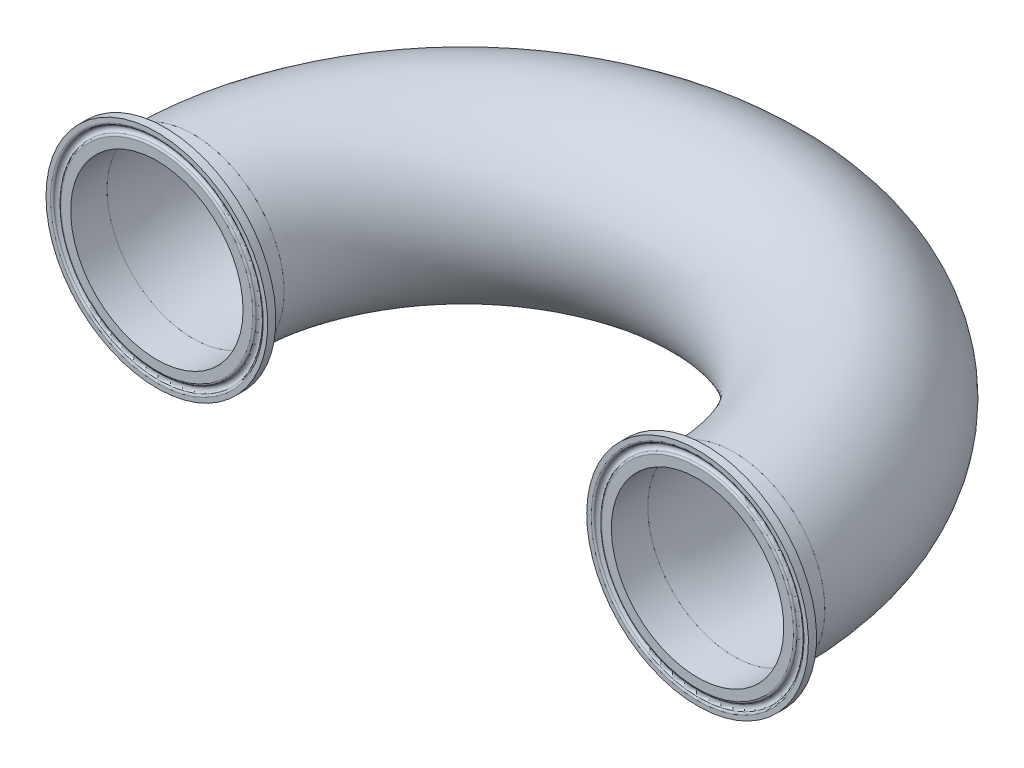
ISO-10303-21;
HEADER;
FILE_DESCRIPTION(('STEP AP214'),'2;1');
FILE_NAME('part.step','',(''),(''),'','','');
FILE_SCHEMA(('AUTOMOTIVE_DESIGN { 1 0 10303 214 1 1 1 1 }'));
ENDSEC;
DATA;
#1=APPLICATION_CONTEXT('core data for automotive mechanical design processes');
#2=APPLICATION_PROTOCOL_DEFINITION('international standard','automotive_design',2000,#1);
#3=PRODUCT_CONTEXT('',#1,'mechanical');
#4=PRODUCT('Part','Part','',(#3));
#5=PRODUCT_RELATED_PRODUCT_CATEGORY('part','',(#4));
#6=PRODUCT_DEFINITION_FORMATION('','',#4);
#7=PRODUCT_DEFINITION_CONTEXT('part definition',#1,'design');
#8=PRODUCT_DEFINITION('design','',#6,#7);
#9=PRODUCT_DEFINITION_SHAPE('','',#8);
#10=(LENGTH_UNIT() NAMED_UNIT(*) SI_UNIT(.MILLI.,.METRE.));
#11=(NAMED_UNIT(*) PLANE_ANGLE_UNIT() SI_UNIT($,.RADIAN.));
#12=(NAMED_UNIT(*) SI_UNIT($,.STERADIAN.) SOLID_ANGLE_UNIT());
#13=UNCERTAINTY_MEASURE_WITH_UNIT(LENGTH_MEASURE(1.E-05),#10,'distance_accuracy_value','');
#14=(GEOMETRIC_REPRESENTATION_CONTEXT(3) GLOBAL_UNCERTAINTY_ASSIGNED_CONTEXT((#13)) GLOBAL_UNIT_ASSIGNED_CONTEXT((#10,
#11,#12)) REPRESENTATION_CONTEXT('',''));
#15=CARTESIAN_POINT('',(0.,0.,0.));
#16=DIRECTION('',(0.,0.,1.));
#17=DIRECTION('',(1.,0.,0.));
#18=AXIS2_PLACEMENT_3D('',#15,#16,#17);
#19=CARTESIAN_POINT('',(-22.460954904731,114.012088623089,167.213184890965));
#20=DIRECTION('',(0.,0.,-1.));
#21=DIRECTION('',(-1.,0.,0.));
#22=AXIS2_PLACEMENT_3D('',#19,#20,#21);
#23=CIRCLE('',#22,31.75);
#24=CARTESIAN_POINT('',(72.785229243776,114.012088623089,168.065772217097));
#25=DIRECTION('',(0.,-1.,0.));
#26=AXIS1_PLACEMENT('',#24,#25);
#27=SURFACE_OF_REVOLUTION('',#23,#26);
#28=CARTESIAN_POINT('',(-54.210954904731,114.012088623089,167.213184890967));
#29=VERTEX_POINT('',#28);
#30=EDGE_CURVE('P0_E10',#29,#29,#23,.T.);
#31=ORIENTED_EDGE('',*,*,#30,.T.);
#32=EDGE_LOOP('',(#31));
#33=FACE_BOUND('',#32,.T.);
#34=CARTESIAN_POINT('',(168.031413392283,114.012088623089,168.918359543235));
#35=DIRECTION('',(0.,0.,1.));
#36=DIRECTION('',(1.,0.,0.));
#37=AXIS2_PLACEMENT_3D('',#34,#35,#36);
#38=CIRCLE('',#37,31.75);
#39=CARTESIAN_POINT('',(199.781413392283,114.012088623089,168.918359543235));
#40=VERTEX_POINT('',#39);
#41=EDGE_CURVE('P0_E22',#40,#40,#38,.T.);
#42=ORIENTED_EDGE('',*,*,#41,.F.);
#43=EDGE_LOOP('',(#42));
#44=FACE_BOUND('',#43,.T.);
#45=ADVANCED_FACE('P0_F15',(#33,#44),#27,.F.);
#46=CARTESIAN_POINT('',(-22.460954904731,114.012088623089,167.213184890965));
#47=DIRECTION('',(0.,0.,-1.));
#48=DIRECTION('',(-1.,0.,0.));
#49=AXIS2_PLACEMENT_3D('',#46,#47,#48);
#50=PLANE('',#49);
#51=CARTESIAN_POINT('',(7.63790004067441,114.012088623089,167.213184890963));
#52=CARTESIAN_POINT('',(7.6379061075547,113.166442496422,167.213184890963));
#53=CARTESIAN_POINT('',(7.60224746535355,112.320895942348,167.213184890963));
#54=CARTESIAN_POINT('',(7.45986179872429,110.635530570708,167.213184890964));
#55=CARTESIAN_POINT('',(7.35311607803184,109.795713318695,167.213184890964));
#56=CARTESIAN_POINT('',(7.06913100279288,108.127139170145,167.213184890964));
#57=CARTESIAN_POINT('',(6.89181367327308,107.298395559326,167.213184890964));
#58=CARTESIAN_POINT('',(6.46796481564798,105.658855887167,167.213184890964));
#59=CARTESIAN_POINT('',(6.2214378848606,104.848058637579,167.213184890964));
#60=CARTESIAN_POINT('',(5.66104594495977,103.250492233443,167.213184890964));
#61=CARTESIAN_POINT('',(5.3472114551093,102.463712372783,167.213184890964));
#62=CARTESIAN_POINT('',(4.65436468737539,100.919378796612,167.213184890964));
#63=CARTESIAN_POINT('',(4.27535138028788,100.161825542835,167.213184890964));
#64=CARTESIAN_POINT('',(3.45495026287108,98.681534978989,167.213184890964));
#65=CARTESIAN_POINT('',(3.01357837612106,97.9587888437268,167.213184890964));
#66=CARTESIAN_POINT('',(2.0715261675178,96.5530457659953,167.213184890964));
#67=CARTESIAN_POINT('',(1.57084607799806,95.8700486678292,167.213184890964));
#68=CARTESIAN_POINT('',(0.513681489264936,94.5485888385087,167.213184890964));
#69=CARTESIAN_POINT('',(-0.0428086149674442,93.9101305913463,167.213184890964));
#70=CARTESIAN_POINT('',(-1.20759572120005,92.682362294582,167.213184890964));
#71=CARTESIAN_POINT('',(-1.81589277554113,92.0930522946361,167.213184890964));
#72=CARTESIAN_POINT('',(-3.07999346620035,90.9677488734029,167.213184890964));
#73=CARTESIAN_POINT('',(-3.73579894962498,90.4317575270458,167.213184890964));
#74=CARTESIAN_POINT('',(-5.09023283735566,89.41692840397,167.213184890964));
#75=CARTESIAN_POINT('',(-5.78886123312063,88.9380906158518,167.213184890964));
#76=CARTESIAN_POINT('',(-7.22395590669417,88.0409842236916,167.213184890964));
#77=CARTESIAN_POINT('',(-7.96042123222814,87.6227140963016,167.213184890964));
#78=CARTESIAN_POINT('',(-9.46597008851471,86.8497023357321,167.213184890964));
#79=CARTESIAN_POINT('',(-10.235053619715,86.4949607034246,167.213184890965));
#80=CARTESIAN_POINT('',(-11.8003695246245,85.851528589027,167.213184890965));
#81=CARTESIAN_POINT('',(-12.5966018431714,85.5628379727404,167.213184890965));
#82=CARTESIAN_POINT('',(-14.2105560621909,85.0535593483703,167.213184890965));
#83=CARTESIAN_POINT('',(-15.0282779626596,84.8329713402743,167.213184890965));
#84=CARTESIAN_POINT('',(-16.6793987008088,84.4614659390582,167.213184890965));
#85=CARTESIAN_POINT('',(-17.5127975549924,84.3105486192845,167.213184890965));
#86=CARTESIAN_POINT('',(-19.1893463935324,84.0794578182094,167.213184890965));
#87=CARTESIAN_POINT('',(-20.032496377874,83.9992843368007,167.213184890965));
#88=CARTESIAN_POINT('',(-21.7225516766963,83.9102512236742,167.213184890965));
#89=CARTESIAN_POINT('',(-22.5694569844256,83.9013914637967,167.213184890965));
#90=CARTESIAN_POINT('',(-24.2610034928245,83.955048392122,167.213184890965));
#91=CARTESIAN_POINT('',(-25.1056446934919,84.0175650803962,167.213184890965));
#92=CARTESIAN_POINT('',(-26.7866604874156,84.2135306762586,167.213184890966));
#93=CARTESIAN_POINT('',(-27.6230350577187,84.3469797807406,167.213184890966));
#94=CARTESIAN_POINT('',(-29.2815691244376,84.6838615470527,167.213184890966));
#95=CARTESIAN_POINT('',(-30.1037286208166,84.8872942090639,167.213184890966));
#96=CARTESIAN_POINT('',(-31.7279883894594,85.3626970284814,167.213184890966));
#97=CARTESIAN_POINT('',(-32.5300886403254,85.6346672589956,167.213184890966));
#98=CARTESIAN_POINT('',(-34.1085265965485,86.2452115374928,167.213184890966));
#99=CARTESIAN_POINT('',(-34.8848643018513,86.5837855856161,167.213184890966));
#100=CARTESIAN_POINT('',(-36.406259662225,87.3251312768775,167.213184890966));
#101=CARTESIAN_POINT('',(-37.1513172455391,87.727903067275,167.213184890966));
#102=CARTESIAN_POINT('',(-38.604853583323,88.5947802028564,167.213184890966));
#103=CARTESIAN_POINT('',(-39.3133323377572,89.0588855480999,167.213184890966));
#104=CARTESIAN_POINT('',(-40.6886739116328,90.0451300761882,167.213184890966));
#105=CARTESIAN_POINT('',(-41.355536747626,90.5672692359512,167.213184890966));
#106=CARTESIAN_POINT('',(-42.6429058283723,91.6658694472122,167.213184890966));
#107=CARTESIAN_POINT('',(-43.2634120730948,92.2423304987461,167.213184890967));
#108=CARTESIAN_POINT('',(-44.453657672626,93.4454773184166,167.213184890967));
#109=CARTESIAN_POINT('',(-45.0233969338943,94.0721631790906,167.213184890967));
#110=CARTESIAN_POINT('',(-46.1080567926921,95.37130333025,167.213184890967));
#111=CARTESIAN_POINT('',(-46.6229773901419,96.043757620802,167.213184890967));
#112=CARTESIAN_POINT('',(-47.5943392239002,97.4296539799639,167.213184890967));
#113=CARTESIAN_POINT('',(-48.0507804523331,98.1430960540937,167.213184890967));
#114=CARTESIAN_POINT('',(-48.9019384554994,99.6058957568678,167.213184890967));
#115=CARTESIAN_POINT('',(-49.296655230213,100.355253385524,167.213184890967));
#116=CARTESIAN_POINT('',(-50.0215584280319,101.884557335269,167.213184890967));
#117=CARTESIAN_POINT('',(-50.3517447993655,102.6645036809,167.213184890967));
#118=CARTESIAN_POINT('',(-50.9452393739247,104.24943954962,167.213184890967));
#119=CARTESIAN_POINT('',(-51.2085475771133,105.054429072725,167.213184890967));
#120=CARTESIAN_POINT('',(-51.666413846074,106.683728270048,167.213184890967));
#121=CARTESIAN_POINT('',(-51.8609719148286,107.508037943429,167.213184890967));
#122=CARTESIAN_POINT('',(-52.1799547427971,109.170117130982,167.213184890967));
#123=CARTESIAN_POINT('',(-52.3043795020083,110.007886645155,167.213184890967));
#124=CARTESIAN_POINT('',(-52.482211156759,111.690929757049,167.213184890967));
#125=CARTESIAN_POINT('',(-52.5356180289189,112.536203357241,167.213184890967));
#126=CARTESIAN_POINT('',(-52.5710341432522,114.228244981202,167.213184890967));
#127=CARTESIAN_POINT('',(-52.5530433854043,115.075013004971,167.213184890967));
#128=CARTESIAN_POINT('',(-52.445792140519,116.764023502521,167.213184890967));
#129=CARTESIAN_POINT('',(-52.3565316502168,117.606265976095,167.213184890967));
#130=CARTESIAN_POINT('',(-52.1073755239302,119.280237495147,167.213184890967));
#131=CARTESIAN_POINT('',(-51.9474798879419,120.111966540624,167.213184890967));
#132=CARTESIAN_POINT('',(-51.5581902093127,121.758998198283,167.213184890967));
#133=CARTESIAN_POINT('',(-51.3287961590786,122.57430080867,167.213184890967));
#134=CARTESIAN_POINT('',(-50.8021405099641,124.182683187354,167.213184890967));
#135=CARTESIAN_POINT('',(-50.5048789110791,124.975762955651,167.213184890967));
#136=CARTESIAN_POINT('',(-49.8446015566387,126.534061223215,167.213184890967));
#137=CARTESIAN_POINT('',(-49.4815858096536,127.299279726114,167.213184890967));
#138=CARTESIAN_POINT('',(-48.6923809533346,128.796415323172,167.213184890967));
#139=CARTESIAN_POINT('',(-48.2661918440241,129.528332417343,167.213184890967));
#140=CARTESIAN_POINT('',(-47.3536703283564,130.953661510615,167.213184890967));
#141=CARTESIAN_POINT('',(-46.8673379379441,131.647073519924,167.213184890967));
#142=CARTESIAN_POINT('',(-45.8379872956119,132.990462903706,167.213184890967));
#143=CARTESIAN_POINT('',(-45.2949690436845,133.640440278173,167.213184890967));
#144=CARTESIAN_POINT('',(-44.1561069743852,134.892339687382,167.213184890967));
#145=CARTESIAN_POINT('',(-43.5602631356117,135.494261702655,167.213184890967));
#146=CARTESIAN_POINT('',(-42.3199861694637,136.645770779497,167.213184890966));
#147=CARTESIAN_POINT('',(-41.6755530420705,137.195357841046,167.213184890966));
#148=CARTESIAN_POINT('',(-40.3426791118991,138.238289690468,167.213184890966));
#149=CARTESIAN_POINT('',(-39.6542383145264,138.73163448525,167.213184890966));
#150=CARTESIAN_POINT('',(-38.2382433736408,139.658574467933,167.213184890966));
#151=CARTESIAN_POINT('',(-37.5106892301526,140.092169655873,167.213184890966));
#152=CARTESIAN_POINT('',(-36.0216408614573,140.896527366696,167.213184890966));
#153=CARTESIAN_POINT('',(-35.2601466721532,141.267289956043,167.213184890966));
#154=CARTESIAN_POINT('',(-33.7086312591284,141.943347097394,167.213184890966));
#155=CARTESIAN_POINT('',(-32.9186100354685,142.248641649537,167.213184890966));
#156=CARTESIAN_POINT('',(-31.315658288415,142.791591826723,167.213184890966));
#157=CARTESIAN_POINT('',(-30.5027277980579,143.029247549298,167.213184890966));
#158=CARTESIAN_POINT('',(-28.8597358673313,143.435231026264,167.213184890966));
#159=CARTESIAN_POINT('',(-28.0296744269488,143.603558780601,167.213184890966));
#160=CARTESIAN_POINT('',(-26.3583203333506,143.869689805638,167.213184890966));
#161=CARTESIAN_POINT('',(-25.5170276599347,143.967492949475,167.213184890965));
#162=CARTESIAN_POINT('',(-23.8291936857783,144.091878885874,167.213184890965));
#163=CARTESIAN_POINT('',(-22.9826523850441,144.118461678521,167.213184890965));
#164=CARTESIAN_POINT('',(-21.2903429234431,144.100217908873,167.213184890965));
#165=CARTESIAN_POINT('',(-20.4445747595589,144.05539162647,167.213184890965));
#166=CARTESIAN_POINT('',(-18.7598211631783,143.894648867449,167.213184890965));
#167=CARTESIAN_POINT('',(-17.9208357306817,143.778732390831,167.213184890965));
#168=CARTESIAN_POINT('',(-16.2556106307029,143.476632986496,167.213184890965));
#169=CARTESIAN_POINT('',(-15.4293709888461,143.290449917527,167.213184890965));
#170=CARTESIAN_POINT('',(-13.7955133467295,142.849140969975,167.213184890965));
#171=CARTESIAN_POINT('',(-12.9878953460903,142.594015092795,167.213184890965));
#172=CARTESIAN_POINT('',(-11.3970101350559,142.016629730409,167.213184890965));
#173=CARTESIAN_POINT('',(-10.613743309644,141.694369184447,167.213184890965));
#174=CARTESIAN_POINT('',(-9.07714245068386,140.98500800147,167.213184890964));
#175=CARTESIAN_POINT('',(-8.32380842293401,140.597907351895,167.213184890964));
#176=CARTESIAN_POINT('',(-6.85245799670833,139.761634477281,167.213184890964));
#177=CARTESIAN_POINT('',(-6.13444022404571,139.312464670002,167.213184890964));
#178=CARTESIAN_POINT('',(-4.73879605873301,138.355235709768,167.213184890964));
#179=CARTESIAN_POINT('',(-4.06116962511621,137.847176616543,167.213184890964));
#180=CARTESIAN_POINT('',(-2.75119555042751,136.775838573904,167.213184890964));
#181=CARTESIAN_POINT('',(-2.11884302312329,136.212565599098,167.213184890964));
#182=CARTESIAN_POINT('',(-0.903828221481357,135.034755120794,167.213184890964));
#183=CARTESIAN_POINT('',(-0.321166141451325,134.420217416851,167.213184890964));
#184=CARTESIAN_POINT('',(0.790465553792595,133.14408438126,167.213184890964));
#185=CARTESIAN_POINT('',(1.31942144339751,132.482477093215,167.213184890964));
#186=CARTESIAN_POINT('',(2.31970200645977,131.117059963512,167.213184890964));
#187=CARTESIAN_POINT('',(2.79102758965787,130.413250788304,167.213184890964));
#188=CARTESIAN_POINT('',(3.67290698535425,128.968094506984,167.213184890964));
#189=CARTESIAN_POINT('',(4.08343301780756,128.226730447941,167.213184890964));
#190=CARTESIAN_POINT('',(4.84055961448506,126.711990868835,167.213184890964));
#191=CARTESIAN_POINT('',(5.18715593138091,125.938613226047,167.213184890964));
#192=CARTESIAN_POINT('',(5.81357723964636,124.366251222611,167.213184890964));
#193=CARTESIAN_POINT('',(6.09347570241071,123.567296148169,167.213184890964));
#194=CARTESIAN_POINT('',(6.58493591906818,121.94892166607,167.213184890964));
#195=CARTESIAN_POINT('',(6.79651562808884,121.129507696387,167.213184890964));
#196=CARTESIAN_POINT('',(7.19394511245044,119.269770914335,167.213184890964));
#197=CARTESIAN_POINT('',(7.3602869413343,118.225222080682,167.213184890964));
#198=CARTESIAN_POINT('',(7.58226061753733,116.124426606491,167.213184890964));
#199=CARTESIAN_POINT('',(7.63789246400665,115.068179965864,167.213184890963));
#200=CARTESIAN_POINT('',(7.63790004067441,114.012088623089,167.213184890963));
#201=B_SPLINE_CURVE_WITH_KNOTS('',3,(#51,#52,#53,#54,#55,#56,#57,#58,#59,#60,#61,#62,#63,#64,
#65,#66,#67,#68,#69,#70,#71,#72,#73,#74,#75,#76,#77,#78,#79,#80,#81,#82,#83,#84,#85,#86,#87,#88,
#89,#90,#91,#92,#93,#94,#95,#96,#97,#98,#99,#100,#101,#102,#103,#104,#105,#106,#107,#108,#109,
#110,#111,#112,#113,#114,#115,#116,#117,#118,#119,#120,#121,#122,#123,#124,#125,#126,#127,#128,
#129,#130,#131,#132,#133,#134,#135,#136,#137,#138,#139,#140,#141,#142,#143,#144,#145,#146,#147,
#148,#149,#150,#151,#152,#153,#154,#155,#156,#157,#158,#159,#160,#161,#162,#163,#164,#165,#166,
#167,#168,#169,#170,#171,#172,#173,#174,#175,#176,#177,#178,#179,#180,#181,#182,#183,#184,#185,
#186,#187,#188,#189,#190,#191,#192,#193,#194,#195,#196,#197,#198,#199,#200),.UNSPECIFIED.,.T.,
.F.,(4,2,2,2,2,2,2,2,2,2,2,2,2,2,2,2,2,2,2,2,2,2,2,2,2,2,2,2,2,2,2,2,2,2,2,2,2,2,2,2,2,2,2,2,2,
2,2,2,2,2,2,2,2,2,2,2,2,2,2,2,2,2,2,2,2,2,2,2,2,2,2,2,2,2,4),(0.,2.53601589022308,
5.07269902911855,7.61219277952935,10.151517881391,12.689694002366,15.2279102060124,
17.765479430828,20.303038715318,22.8408531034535,25.3786700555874,27.9165857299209,
30.454500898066,32.9923522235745,35.5302035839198,38.0680497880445,40.605895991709,
43.1437448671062,45.6815937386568,48.2194380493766,50.7572823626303,53.2951337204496,
55.8329850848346,58.3708391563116,60.9086932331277,63.4465531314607,65.9844130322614,
68.5222719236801,71.0601308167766,73.5979943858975,76.1358579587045,78.6737218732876,
81.2115857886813,83.7494517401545,86.2873176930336,88.8251835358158,91.3630493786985,
93.9009160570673,96.4387827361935,98.9766495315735,101.51451632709,104.052383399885,
106.590250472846,109.128117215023,111.665983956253,114.203850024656,116.741716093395,
119.279583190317,121.817450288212,124.35531707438,126.893183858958,129.431047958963,
131.968912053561,134.5067724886,137.044632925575,139.582497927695,142.120362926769,
144.658217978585,147.196073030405,149.733933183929,152.271793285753,154.809693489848,
157.347594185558,159.885396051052,162.42319534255,164.960720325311,167.498255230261,
170.036437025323,172.57457874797,175.113876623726,177.653343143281,180.189999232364,
182.725988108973,185.893110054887,189.060232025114),.UNSPECIFIED.);
#202=CARTESIAN_POINT('',(7.63790004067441,114.012088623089,167.213184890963));
#203=VERTEX_POINT('',#202);
#204=EDGE_CURVE('P0_E26',#203,#203,#201,.T.);
#205=ORIENTED_EDGE('',*,*,#204,.T.);
#206=EDGE_LOOP('',(#205));
#207=FACE_BOUND('',#206,.T.);
#208=ORIENTED_EDGE('',*,*,#30,.F.);
#209=EDGE_LOOP('',(#208));
#210=FACE_BOUND('',#209,.T.);
#211=ADVANCED_FACE('P0_F53',(#207,#210),#50,.F.);
#212=CARTESIAN_POINT('',(168.031413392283,114.012088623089,168.918359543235));
#213=DIRECTION('',(0.,0.,1.));
#214=DIRECTION('',(1.,0.,0.));
#215=AXIS2_PLACEMENT_3D('',#212,#213,#214);
#216=PLANE('',#215);
#217=CARTESIAN_POINT('',(137.932558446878,114.012088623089,168.918359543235));
#218=CARTESIAN_POINT('',(137.932552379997,113.166442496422,168.918359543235));
#219=CARTESIAN_POINT('',(137.968211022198,112.320895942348,168.918359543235));
#220=CARTESIAN_POINT('',(138.110596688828,110.635530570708,168.918359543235));
#221=CARTESIAN_POINT('',(138.21734240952,109.795713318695,168.918359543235));
#222=CARTESIAN_POINT('',(138.501327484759,108.127139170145,168.918359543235));
#223=CARTESIAN_POINT('',(138.678644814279,107.298395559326,168.918359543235));
#224=CARTESIAN_POINT('',(139.102493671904,105.658855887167,168.918359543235));
#225=CARTESIAN_POINT('',(139.349020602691,104.848058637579,168.918359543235));
#226=CARTESIAN_POINT('',(139.909412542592,103.250492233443,168.918359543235));
#227=CARTESIAN_POINT('',(140.223247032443,102.463712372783,168.918359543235));
#228=CARTESIAN_POINT('',(140.916093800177,100.919378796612,168.918359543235));
#229=CARTESIAN_POINT('',(141.295107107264,100.161825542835,168.918359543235));
#230=CARTESIAN_POINT('',(142.115508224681,98.681534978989,168.918359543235));
#231=CARTESIAN_POINT('',(142.556880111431,97.9587888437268,168.918359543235));
#232=CARTESIAN_POINT('',(143.498932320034,96.5530457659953,168.918359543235));
#233=CARTESIAN_POINT('',(143.999612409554,95.8700486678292,168.918359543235));
#234=CARTESIAN_POINT('',(145.056776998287,94.5485888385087,168.918359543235));
#235=CARTESIAN_POINT('',(145.61326710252,93.9101305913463,168.918359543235));
#236=CARTESIAN_POINT('',(146.778054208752,92.682362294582,168.918359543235));
#237=CARTESIAN_POINT('',(147.386351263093,92.0930522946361,168.918359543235));
#238=CARTESIAN_POINT('',(148.650451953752,90.9677488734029,168.918359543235));
#239=CARTESIAN_POINT('',(149.306257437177,90.4317575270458,168.918359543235));
#240=CARTESIAN_POINT('',(150.660691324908,89.4169284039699,168.918359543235));
#241=CARTESIAN_POINT('',(151.359319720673,88.9380906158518,168.918359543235));
#242=CARTESIAN_POINT('',(152.794414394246,88.0409842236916,168.918359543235));
#243=CARTESIAN_POINT('',(153.53087971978,87.6227140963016,168.918359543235));
#244=CARTESIAN_POINT('',(155.036428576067,86.8497023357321,168.918359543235));
#245=CARTESIAN_POINT('',(155.805512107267,86.4949607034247,168.918359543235));
#246=CARTESIAN_POINT('',(157.370828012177,85.851528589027,168.918359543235));
#247=CARTESIAN_POINT('',(158.167060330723,85.5628379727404,168.918359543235));
#248=CARTESIAN_POINT('',(159.781014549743,85.0535593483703,168.918359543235));
#249=CARTESIAN_POINT('',(160.598736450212,84.8329713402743,168.918359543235));
#250=CARTESIAN_POINT('',(162.249857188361,84.4614659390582,168.918359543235));
#251=CARTESIAN_POINT('',(163.083256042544,84.3105486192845,168.918359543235));
#252=CARTESIAN_POINT('',(164.759804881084,84.0794578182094,168.918359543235));
#253=CARTESIAN_POINT('',(165.602954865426,83.9992843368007,168.918359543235));
#254=CARTESIAN_POINT('',(167.293010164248,83.9102512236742,168.918359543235));
#255=CARTESIAN_POINT('',(168.139915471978,83.9013914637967,168.918359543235));
#256=CARTESIAN_POINT('',(169.831461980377,83.955048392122,168.918359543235));
#257=CARTESIAN_POINT('',(170.676103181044,84.0175650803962,168.918359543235));
#258=CARTESIAN_POINT('',(172.357118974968,84.2135306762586,168.918359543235));
#259=CARTESIAN_POINT('',(173.193493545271,84.3469797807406,168.918359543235));
#260=CARTESIAN_POINT('',(174.85202761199,84.6838615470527,168.918359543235));
#261=CARTESIAN_POINT('',(175.674187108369,84.8872942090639,168.918359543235));
#262=CARTESIAN_POINT('',(177.298446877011,85.3626970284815,168.918359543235));
#263=CARTESIAN_POINT('',(178.100547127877,85.6346672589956,168.918359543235));
#264=CARTESIAN_POINT('',(179.678985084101,86.2452115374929,168.918359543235));
#265=CARTESIAN_POINT('',(180.455322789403,86.5837855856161,168.918359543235));
#266=CARTESIAN_POINT('',(181.976718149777,87.3251312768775,168.918359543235));
#267=CARTESIAN_POINT('',(182.721775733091,87.727903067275,168.918359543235));
#268=CARTESIAN_POINT('',(184.175312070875,88.5947802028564,168.918359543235));
#269=CARTESIAN_POINT('',(184.883790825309,89.0588855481,168.918359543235));
#270=CARTESIAN_POINT('',(186.259132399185,90.0451300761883,168.918359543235));
#271=CARTESIAN_POINT('',(186.925995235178,90.5672692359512,168.918359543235));
#272=CARTESIAN_POINT('',(188.213364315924,91.6658694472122,168.918359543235));
#273=CARTESIAN_POINT('',(188.833870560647,92.2423304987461,168.918359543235));
#274=CARTESIAN_POINT('',(190.024116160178,93.4454773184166,168.918359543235));
#275=CARTESIAN_POINT('',(190.593855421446,94.0721631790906,168.918359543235));
#276=CARTESIAN_POINT('',(191.678515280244,95.37130333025,168.918359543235));
#277=CARTESIAN_POINT('',(192.193435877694,96.043757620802,168.918359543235));
#278=CARTESIAN_POINT('',(193.164797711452,97.4296539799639,168.918359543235));
#279=CARTESIAN_POINT('',(193.621238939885,98.1430960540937,168.918359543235));
#280=CARTESIAN_POINT('',(194.472396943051,99.6058957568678,168.918359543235));
#281=CARTESIAN_POINT('',(194.867113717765,100.355253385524,168.918359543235));
#282=CARTESIAN_POINT('',(195.592016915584,101.884557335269,168.918359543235));
#283=CARTESIAN_POINT('',(195.922203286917,102.6645036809,168.918359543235));
#284=CARTESIAN_POINT('',(196.515697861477,104.24943954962,168.918359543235));
#285=CARTESIAN_POINT('',(196.779006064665,105.054429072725,168.918359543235));
#286=CARTESIAN_POINT('',(197.236872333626,106.683728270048,168.918359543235));
#287=CARTESIAN_POINT('',(197.431430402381,107.508037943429,168.918359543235));
#288=CARTESIAN_POINT('',(197.750413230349,109.170117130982,168.918359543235));
#289=CARTESIAN_POINT('',(197.87483798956,110.007886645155,168.918359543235));
#290=CARTESIAN_POINT('',(198.052669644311,111.690929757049,168.918359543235));
#291=CARTESIAN_POINT('',(198.106076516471,112.536203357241,168.918359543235));
#292=CARTESIAN_POINT('',(198.141492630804,114.228244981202,168.918359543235));
#293=CARTESIAN_POINT('',(198.123501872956,115.075013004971,168.918359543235));
#294=CARTESIAN_POINT('',(198.016250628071,116.764023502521,168.918359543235));
#295=CARTESIAN_POINT('',(197.926990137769,117.606265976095,168.918359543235));
#296=CARTESIAN_POINT('',(197.677834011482,119.280237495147,168.918359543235));
#297=CARTESIAN_POINT('',(197.517938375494,120.111966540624,168.918359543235));
#298=CARTESIAN_POINT('',(197.128648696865,121.758998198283,168.918359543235));
#299=CARTESIAN_POINT('',(196.899254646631,122.57430080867,168.918359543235));
#300=CARTESIAN_POINT('',(196.372598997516,124.182683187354,168.918359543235));
#301=CARTESIAN_POINT('',(196.075337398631,124.975762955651,168.918359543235));
#302=CARTESIAN_POINT('',(195.415060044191,126.534061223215,168.918359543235));
#303=CARTESIAN_POINT('',(195.052044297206,127.299279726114,168.918359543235));
#304=CARTESIAN_POINT('',(194.262839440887,128.796415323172,168.918359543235));
#305=CARTESIAN_POINT('',(193.836650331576,129.528332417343,168.918359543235));
#306=CARTESIAN_POINT('',(192.924128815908,130.953661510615,168.918359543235));
#307=CARTESIAN_POINT('',(192.437796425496,131.647073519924,168.918359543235));
#308=CARTESIAN_POINT('',(191.408445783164,132.990462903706,168.918359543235));
#309=CARTESIAN_POINT('',(190.865427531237,133.640440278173,168.918359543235));
#310=CARTESIAN_POINT('',(189.726565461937,134.892339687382,168.918359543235));
#311=CARTESIAN_POINT('',(189.130721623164,135.494261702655,168.918359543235));
#312=CARTESIAN_POINT('',(187.890444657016,136.645770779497,168.918359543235));
#313=CARTESIAN_POINT('',(187.246011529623,137.195357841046,168.918359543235));
#314=CARTESIAN_POINT('',(185.913137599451,138.238289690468,168.918359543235));
#315=CARTESIAN_POINT('',(185.224696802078,138.73163448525,168.918359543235));
#316=CARTESIAN_POINT('',(183.808701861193,139.658574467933,168.918359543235));
#317=CARTESIAN_POINT('',(183.081147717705,140.092169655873,168.918359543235));
#318=CARTESIAN_POINT('',(181.592099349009,140.896527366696,168.918359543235));
#319=CARTESIAN_POINT('',(180.830605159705,141.267289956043,168.918359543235));
#320=CARTESIAN_POINT('',(179.27908974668,141.943347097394,168.918359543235));
#321=CARTESIAN_POINT('',(178.489068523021,142.248641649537,168.918359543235));
#322=CARTESIAN_POINT('',(176.886116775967,142.791591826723,168.918359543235));
#323=CARTESIAN_POINT('',(176.07318628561,143.029247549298,168.918359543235));
#324=CARTESIAN_POINT('',(174.430194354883,143.435231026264,168.918359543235));
#325=CARTESIAN_POINT('',(173.600132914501,143.603558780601,168.918359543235));
#326=CARTESIAN_POINT('',(171.928778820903,143.869689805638,168.918359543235));
#327=CARTESIAN_POINT('',(171.087486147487,143.967492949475,168.918359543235));
#328=CARTESIAN_POINT('',(169.39965217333,144.091878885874,168.918359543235));
#329=CARTESIAN_POINT('',(168.553110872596,144.118461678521,168.918359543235));
#330=CARTESIAN_POINT('',(166.860801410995,144.100217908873,168.918359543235));
#331=CARTESIAN_POINT('',(166.015033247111,144.05539162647,168.918359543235));
#332=CARTESIAN_POINT('',(164.33027965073,143.894648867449,168.918359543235));
#333=CARTESIAN_POINT('',(163.491294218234,143.778732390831,168.918359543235));
#334=CARTESIAN_POINT('',(161.826069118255,143.476632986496,168.918359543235));
#335=CARTESIAN_POINT('',(160.999829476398,143.290449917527,168.918359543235));
#336=CARTESIAN_POINT('',(159.365971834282,142.849140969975,168.918359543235));
#337=CARTESIAN_POINT('',(158.558353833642,142.594015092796,168.918359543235));
#338=CARTESIAN_POINT('',(156.967468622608,142.016629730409,168.918359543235));
#339=CARTESIAN_POINT('',(156.184201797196,141.694369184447,168.918359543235));
#340=CARTESIAN_POINT('',(154.647600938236,140.98500800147,168.918359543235));
#341=CARTESIAN_POINT('',(153.894266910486,140.597907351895,168.918359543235));
#342=CARTESIAN_POINT('',(152.42291648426,139.761634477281,168.918359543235));
#343=CARTESIAN_POINT('',(151.704898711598,139.312464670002,168.918359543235));
#344=CARTESIAN_POINT('',(150.309254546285,138.355235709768,168.918359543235));
#345=CARTESIAN_POINT('',(149.631628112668,137.847176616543,168.918359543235));
#346=CARTESIAN_POINT('',(148.32165403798,136.775838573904,168.918359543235));
#347=CARTESIAN_POINT('',(147.689301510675,136.212565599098,168.918359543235));
#348=CARTESIAN_POINT('',(146.474286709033,135.034755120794,168.918359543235));
#349=CARTESIAN_POINT('',(145.891624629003,134.420217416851,168.918359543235));
#350=CARTESIAN_POINT('',(144.779992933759,133.14408438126,168.918359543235));
#351=CARTESIAN_POINT('',(144.251037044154,132.482477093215,168.918359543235));
#352=CARTESIAN_POINT('',(143.250756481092,131.117059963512,168.918359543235));
#353=CARTESIAN_POINT('',(142.779430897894,130.413250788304,168.918359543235));
#354=CARTESIAN_POINT('',(141.897551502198,128.968094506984,168.918359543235));
#355=CARTESIAN_POINT('',(141.487025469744,128.226730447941,168.918359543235));
#356=CARTESIAN_POINT('',(140.729898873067,126.711990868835,168.918359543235));
#357=CARTESIAN_POINT('',(140.383302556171,125.938613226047,168.918359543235));
#358=CARTESIAN_POINT('',(139.756881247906,124.366251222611,168.918359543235));
#359=CARTESIAN_POINT('',(139.476982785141,123.567296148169,168.918359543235));
#360=CARTESIAN_POINT('',(138.985522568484,121.94892166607,168.918359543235));
#361=CARTESIAN_POINT('',(138.773942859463,121.129507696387,168.918359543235));
#362=CARTESIAN_POINT('',(138.376513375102,119.269770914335,168.918359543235));
#363=CARTESIAN_POINT('',(138.210171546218,118.225222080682,168.918359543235));
#364=CARTESIAN_POINT('',(137.988197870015,116.124426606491,168.918359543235));
#365=CARTESIAN_POINT('',(137.932566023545,115.068179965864,168.918359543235));
#366=CARTESIAN_POINT('',(137.932558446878,114.012088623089,168.918359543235));
#367=B_SPLINE_CURVE_WITH_KNOTS('',3,(#217,#218,#219,#220,#221,#222,#223,#224,#225,#226,#227,
#228,#229,#230,#231,#232,#233,#234,#235,#236,#237,#238,#239,#240,#241,#242,#243,#244,#245,#246,
#247,#248,#249,#250,#251,#252,#253,#254,#255,#256,#257,#258,#259,#260,#261,#262,#263,#264,#265,
#266,#267,#268,#269,#270,#271,#272,#273,#274,#275,#276,#277,#278,#279,#280,#281,#282,#283,#284,
#285,#286,#287,#288,#289,#290,#291,#292,#293,#294,#295,#296,#297,#298,#299,#300,#301,#302,#303,
#304,#305,#306,#307,#308,#309,#310,#311,#312,#313,#314,#315,#316,#317,#318,#319,#320,#321,#322,
#323,#324,#325,#326,#327,#328,#329,#330,#331,#332,#333,#334,#335,#336,#337,#338,#339,#340,#341,
#342,#343,#344,#345,#346,#347,#348,#349,#350,#351,#352,#353,#354,#355,#356,#357,#358,#359,#360,
#361,#362,#363,#364,#365,#366),.UNSPECIFIED.,.T.,.F.,(4,2,2,2,2,2,2,2,2,2,2,2,2,2,2,2,2,2,2,2,2,
2,2,2,2,2,2,2,2,2,2,2,2,2,2,2,2,2,2,2,2,2,2,2,2,2,2,2,2,2,2,2,2,2,2,2,2,2,2,2,2,2,2,2,2,2,2,2,2,
2,2,2,2,2,4),(0.,2.53601589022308,5.07269902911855,7.61219277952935,10.1515178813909,
12.689694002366,15.2279102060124,17.765479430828,20.303038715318,22.8408531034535,
25.3786700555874,27.9165857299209,30.454500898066,32.9923522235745,35.5302035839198,
38.0680497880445,40.605895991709,43.1437448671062,45.6815937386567,48.2194380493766,
50.7572823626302,53.2951337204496,55.8329850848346,58.3708391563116,60.9086932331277,
63.4465531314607,65.9844130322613,68.5222719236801,71.0601308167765,73.5979943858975,
76.1358579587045,78.6737218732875,81.2115857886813,83.7494517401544,86.2873176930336,
88.8251835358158,91.3630493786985,93.9009160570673,96.4387827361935,98.9766495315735,
101.51451632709,104.052383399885,106.590250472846,109.128117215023,111.665983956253,
114.203850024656,116.741716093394,119.279583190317,121.817450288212,124.35531707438,
126.893183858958,129.431047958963,131.968912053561,134.5067724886,137.044632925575,
139.582497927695,142.120362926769,144.658217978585,147.196073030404,149.733933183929,
152.271793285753,154.809693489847,157.347594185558,159.885396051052,162.42319534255,
164.960720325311,167.498255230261,170.036437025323,172.57457874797,175.113876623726,
177.653343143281,180.189999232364,182.725988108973,185.893110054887,189.060232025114),.UNSPECIFIED.);
#368=CARTESIAN_POINT('',(137.932558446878,114.012088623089,168.918359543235));
#369=VERTEX_POINT('',#368);
#370=EDGE_CURVE('P0_E30',#369,#369,#367,.T.);
#371=ORIENTED_EDGE('',*,*,#370,.F.);
#372=EDGE_LOOP('',(#371));
#373=FACE_BOUND('',#372,.T.);
#374=ORIENTED_EDGE('',*,*,#41,.T.);
#375=EDGE_LOOP('',(#374));
#376=FACE_BOUND('',#375,.T.);
#377=ADVANCED_FACE('P0_F48',(#373,#376),#216,.T.);
#378=CARTESIAN_POINT('',(-22.460954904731,114.012088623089,167.213184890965));
#379=DIRECTION('',(0.,0.,-1.));
#380=DIRECTION('',(-1.,0.,0.));
#381=AXIS2_PLACEMENT_3D('',#378,#379,#380);
#382=CIRCLE('',#381,31.75);
#383=CARTESIAN_POINT('',(72.785229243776,114.012088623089,168.065772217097));
#384=DIRECTION('',(0.,-1.,0.));
#385=AXIS1_PLACEMENT('',#383,#384);
#386=SURFACE_OF_REVOLUTION('',#382,#385);
#387=OFFSET_SURFACE('',#386,1.651,.F.);
#388=ORIENTED_EDGE('',*,*,#204,.F.);
#389=EDGE_LOOP('',(#388));
#390=FACE_BOUND('',#389,.T.);
#391=ORIENTED_EDGE('',*,*,#370,.T.);
#392=EDGE_LOOP('',(#391));
#393=FACE_BOUND('',#392,.T.);
#394=ADVANCED_FACE('P0_F43',(#390,#393),#387,.T.);
#395=CLOSED_SHELL('',(#45,#211,#377,#394));
#396=MANIFOLD_SOLID_BREP('P0_B1',#395);
#397=CARTESIAN_POINT('',(168.031413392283,114.012088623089,180.830959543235));
#398=DIRECTION('',(0.,0.,1.00000000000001));
#399=DIRECTION('',(0.864201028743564,-0.503146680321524,0.));
#400=AXIS2_PLACEMENT_3D('',#397,#398,#399);
#401=TOROIDAL_SURFACE('',#400,37.1367084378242,0.787400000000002);
#402=CARTESIAN_POINT('',(168.031413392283,114.012088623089,181.618359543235));
#403=DIRECTION('',(0.,0.,1.00000000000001));
#404=DIRECTION('',(0.864201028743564,-0.503146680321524,0.));
#405=AXIS2_PLACEMENT_3D('',#402,#403,#404);
#406=CIRCLE('',#405,37.1367084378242);
#407=CARTESIAN_POINT('',(200.124995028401,95.3268770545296,181.618359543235));
#408=VERTEX_POINT('',#407);
#409=EDGE_CURVE('P1_E48',#408,#408,#406,.T.);
#410=ORIENTED_EDGE('',*,*,#409,.T.);
#411=EDGE_LOOP('',(#410));
#412=FACE_BOUND('',#411,.T.);
#413=CARTESIAN_POINT('',(168.031413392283,114.012088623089,181.143900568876));
#414=DIRECTION('',(0.,0.,1.00000000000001));
#415=DIRECTION('',(0.864201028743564,-0.503146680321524,0.));
#416=AXIS2_PLACEMENT_3D('',#413,#414,#415);
#417=CIRCLE('',#416,36.4141666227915);
#418=CARTESIAN_POINT('',(199.500573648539,95.6904215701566,181.143900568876));
#419=VERTEX_POINT('',#418);
#420=EDGE_CURVE('P1_E9',#419,#419,#417,.T.);
#421=ORIENTED_EDGE('',*,*,#420,.F.);
#422=EDGE_LOOP('',(#421));
#423=FACE_BOUND('',#422,.T.);
#424=ADVANCED_FACE('P1_F14',(#412,#423),#401,.T.);
#425=CARTESIAN_POINT('',(168.031413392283,114.012088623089,181.618359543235));
#426=DIRECTION('',(0.,0.,1.00000000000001));
#427=DIRECTION('',(0.864201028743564,-0.503146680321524,0.));
#428=AXIS2_PLACEMENT_3D('',#425,#426,#427);
#429=TOROIDAL_SURFACE('',#428,35.3187,1.1938);
#430=CARTESIAN_POINT('',(168.031413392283,114.012088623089,181.143900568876));
#431=DIRECTION('',(0.,0.,1.00000000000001));
#432=DIRECTION('',(0.864201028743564,-0.503146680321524,0.));
#433=AXIS2_PLACEMENT_3D('',#430,#431,#432);
#434=CIRCLE('',#433,34.2232333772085);
#435=CARTESIAN_POINT('',(197.607166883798,96.7927823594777,181.143900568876));
#436=VERTEX_POINT('',#435);
#437=EDGE_CURVE('P1_E20',#436,#436,#434,.T.);
#438=ORIENTED_EDGE('',*,*,#437,.F.);
#439=EDGE_LOOP('',(#438));
#440=FACE_BOUND('',#439,.T.);
#441=ORIENTED_EDGE('',*,*,#420,.T.);
#442=EDGE_LOOP('',(#441));
#443=FACE_BOUND('',#442,.T.);
#444=ADVANCED_FACE('P1_F97',(#440,#443),#429,.F.);
#445=CARTESIAN_POINT('',(168.031413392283,114.012088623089,180.830959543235));
#446=DIRECTION('',(0.,0.,1.00000000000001));
#447=DIRECTION('',(0.864201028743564,-0.503146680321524,0.));
#448=AXIS2_PLACEMENT_3D('',#445,#446,#447);
#449=TOROIDAL_SURFACE('',#448,33.5006915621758,0.787399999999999);
#450=ORIENTED_EDGE('',*,*,#437,.T.);
#451=EDGE_LOOP('',(#450));
#452=FACE_BOUND('',#451,.T.);
#453=CARTESIAN_POINT('',(168.031413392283,114.012088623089,181.618359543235));
#454=DIRECTION('',(0.,0.,1.00000000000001));
#455=DIRECTION('',(0.864201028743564,-0.503146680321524,0.));
#456=AXIS2_PLACEMENT_3D('',#453,#454,#455);
#457=CIRCLE('',#456,33.5006915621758);
#458=CARTESIAN_POINT('',(196.982745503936,97.1563268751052,181.618359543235));
#459=VERTEX_POINT('',#458);
#460=EDGE_CURVE('P1_E24',#459,#459,#457,.T.);
#461=ORIENTED_EDGE('',*,*,#460,.F.);
#462=EDGE_LOOP('',(#461));
#463=FACE_BOUND('',#462,.T.);
#464=ADVANCED_FACE('P1_F93',(#452,#463),#449,.T.);
#465=CARTESIAN_POINT('',(168.031413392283,114.012088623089,181.618359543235));
#466=DIRECTION('',(0.,0.,-1.00000000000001));
#467=DIRECTION('',(-0.864201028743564,0.503146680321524,0.));
#468=AXIS2_PLACEMENT_3D('',#465,#466,#467);
#469=PLANE('',#468);
#470=CARTESIAN_POINT('',(168.031413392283,114.012088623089,181.618359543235));
#471=DIRECTION('',(0.,0.,1.00000000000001));
#472=DIRECTION('',(0.864201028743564,-0.503146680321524,0.));
#473=AXIS2_PLACEMENT_3D('',#470,#471,#472);
#474=CIRCLE('',#473,30.099);
#475=CARTESIAN_POINT('',(194.043000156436,98.8678766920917,181.618359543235));
#476=VERTEX_POINT('',#475);
#477=EDGE_CURVE('P1_E28',#476,#476,#474,.T.);
#478=ORIENTED_EDGE('',*,*,#477,.F.);
#479=EDGE_LOOP('',(#478));
#480=FACE_BOUND('',#479,.T.);
#481=ORIENTED_EDGE('',*,*,#460,.T.);
#482=EDGE_LOOP('',(#481));
#483=FACE_BOUND('',#482,.T.);
#484=ADVANCED_FACE('P1_F86',(#480,#483),#469,.F.);
#485=CARTESIAN_POINT('',(168.031413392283,114.012088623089,181.618359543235));
#486=DIRECTION('',(0.,0.,1.00000000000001));
#487=DIRECTION('',(0.864201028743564,-0.503146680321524,0.));
#488=AXIS2_PLACEMENT_3D('',#485,#486,#487);
#489=CYLINDRICAL_SURFACE('',#488,30.099);
#490=ORIENTED_EDGE('',*,*,#477,.T.);
#491=EDGE_LOOP('',(#490));
#492=FACE_BOUND('',#491,.T.);
#493=CARTESIAN_POINT('',(168.031413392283,114.012088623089,168.918359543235));
#494=DIRECTION('',(0.,0.,1.00000000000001));
#495=DIRECTION('',(0.864201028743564,-0.503146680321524,0.));
#496=AXIS2_PLACEMENT_3D('',#493,#494,#495);
#497=CIRCLE('',#496,30.099);
#498=CARTESIAN_POINT('',(194.043000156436,98.8678766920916,168.918359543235));
#499=VERTEX_POINT('',#498);
#500=EDGE_CURVE('P1_E33',#499,#499,#497,.T.);
#501=ORIENTED_EDGE('',*,*,#500,.F.);
#502=EDGE_LOOP('',(#501));
#503=FACE_BOUND('',#502,.T.);
#504=ADVANCED_FACE('P1_F81',(#492,#503),#489,.F.);
#505=CARTESIAN_POINT('',(168.031413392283,114.012088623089,168.918359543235));
#506=DIRECTION('',(0.,0.,1.00000000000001));
#507=DIRECTION('',(0.864201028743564,-0.503146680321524,0.));
#508=AXIS2_PLACEMENT_3D('',#505,#506,#507);
#509=PLANE('',#508);
#510=CARTESIAN_POINT('',(168.031413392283,114.012088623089,168.918359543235));
#511=DIRECTION('',(0.,0.,1.00000000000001));
#512=DIRECTION('',(0.864201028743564,-0.503146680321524,0.));
#513=AXIS2_PLACEMENT_3D('',#510,#511,#512);
#514=CIRCLE('',#513,31.75);
#515=CARTESIAN_POINT('',(195.469796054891,98.0371815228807,168.918359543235));
#516=VERTEX_POINT('',#515);
#517=EDGE_CURVE('P1_E36',#516,#516,#514,.T.);
#518=ORIENTED_EDGE('',*,*,#517,.F.);
#519=EDGE_LOOP('',(#518));
#520=FACE_BOUND('',#519,.T.);
#521=ORIENTED_EDGE('',*,*,#500,.T.);
#522=EDGE_LOOP('',(#521));
#523=FACE_BOUND('',#522,.T.);
#524=ADVANCED_FACE('P1_F75',(#520,#523),#509,.F.);
#525=CARTESIAN_POINT('',(168.031413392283,114.012088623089,181.618359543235));
#526=DIRECTION('',(0.,0.,1.00000000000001));
#527=DIRECTION('',(0.864201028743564,-0.503146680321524,0.));
#528=AXIS2_PLACEMENT_3D('',#525,#526,#527);
#529=CYLINDRICAL_SURFACE('',#528,31.75);
#530=CARTESIAN_POINT('',(168.031413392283,114.012088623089,176.240472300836));
#531=DIRECTION('',(0.,0.,1.00000000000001));
#532=DIRECTION('',(0.864201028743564,-0.503146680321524,0.));
#533=AXIS2_PLACEMENT_3D('',#530,#531,#532);
#534=CIRCLE('',#533,31.75);
#535=CARTESIAN_POINT('',(195.469796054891,98.0371815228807,176.240472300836));
#536=VERTEX_POINT('',#535);
#537=EDGE_CURVE('P1_E39',#536,#536,#534,.T.);
#538=ORIENTED_EDGE('',*,*,#537,.F.);
#539=EDGE_LOOP('',(#538));
#540=FACE_BOUND('',#539,.T.);
#541=ORIENTED_EDGE('',*,*,#517,.T.);
#542=EDGE_LOOP('',(#541));
#543=FACE_BOUND('',#542,.T.);
#544=ADVANCED_FACE('P1_F69',(#540,#543),#529,.T.);
#545=CARTESIAN_POINT('',(168.031413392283,114.012088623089,176.240472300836));
#546=DIRECTION('',(0.,0.,1.00000000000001));
#547=DIRECTION('',(0.864201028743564,-0.503146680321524,0.));
#548=AXIS2_PLACEMENT_3D('',#545,#546,#547);
#549=CONICAL_SURFACE('',#548,31.75,1.22173047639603);
#550=CARTESIAN_POINT('',(168.031413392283,114.012088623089,178.773559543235));
#551=DIRECTION('',(0.,0.,1.00000000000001));
#552=DIRECTION('',(0.864201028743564,-0.503146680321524,0.));
#553=AXIS2_PLACEMENT_3D('',#550,#551,#552);
#554=CIRCLE('',#553,38.7096);
#555=CARTESIAN_POINT('',(201.484289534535,94.5354818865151,178.773559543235));
#556=VERTEX_POINT('',#555);
#557=EDGE_CURVE('P1_E42',#556,#556,#554,.T.);
#558=ORIENTED_EDGE('',*,*,#557,.F.);
#559=EDGE_LOOP('',(#558));
#560=FACE_BOUND('',#559,.T.);
#561=ORIENTED_EDGE('',*,*,#537,.T.);
#562=EDGE_LOOP('',(#561));
#563=FACE_BOUND('',#562,.T.);
#564=ADVANCED_FACE('P1_F63',(#560,#563),#549,.T.);
#565=CARTESIAN_POINT('',(168.031413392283,114.012088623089,181.618359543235));
#566=DIRECTION('',(0.,0.,1.00000000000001));
#567=DIRECTION('',(0.864201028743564,-0.503146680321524,0.));
#568=AXIS2_PLACEMENT_3D('',#565,#566,#567);
#569=CYLINDRICAL_SURFACE('',#568,38.7096);
#570=CARTESIAN_POINT('',(168.031413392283,114.012088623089,181.618359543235));
#571=DIRECTION('',(0.,0.,1.00000000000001));
#572=DIRECTION('',(0.864201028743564,-0.503146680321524,0.));
#573=AXIS2_PLACEMENT_3D('',#570,#571,#572);
#574=CIRCLE('',#573,38.7096);
#575=CARTESIAN_POINT('',(201.484289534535,94.5354818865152,181.618359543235));
#576=VERTEX_POINT('',#575);
#577=EDGE_CURVE('P1_E45',#576,#576,#574,.T.);
#578=ORIENTED_EDGE('',*,*,#577,.F.);
#579=EDGE_LOOP('',(#578));
#580=FACE_BOUND('',#579,.T.);
#581=ORIENTED_EDGE('',*,*,#557,.T.);
#582=EDGE_LOOP('',(#581));
#583=FACE_BOUND('',#582,.T.);
#584=ADVANCED_FACE('P1_F57',(#580,#583),#569,.T.);
#585=CARTESIAN_POINT('',(168.031413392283,114.012088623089,181.618359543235));
#586=DIRECTION('',(0.,0.,-1.00000000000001));
#587=DIRECTION('',(-0.864201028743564,0.503146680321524,0.));
#588=AXIS2_PLACEMENT_3D('',#585,#586,#587);
#589=PLANE('',#588);
#590=ORIENTED_EDGE('',*,*,#409,.F.);
#591=EDGE_LOOP('',(#590));
#592=FACE_BOUND('',#591,.T.);
#593=ORIENTED_EDGE('',*,*,#577,.T.);
#594=EDGE_LOOP('',(#593));
#595=FACE_BOUND('',#594,.T.);
#596=ADVANCED_FACE('P1_F54',(#592,#595),#589,.F.);
#597=CLOSED_SHELL('',(#424,#444,#464,#484,#504,#524,#544,#564,#584,#596));
#598=MANIFOLD_SOLID_BREP('P1_B1',#597);
#599=CARTESIAN_POINT('',(-22.4609549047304,114.012088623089,179.125784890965));
#600=DIRECTION('',(0.,0.,1.00000000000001));
#601=DIRECTION('',(0.735446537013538,-0.67758275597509,0.));
#602=AXIS2_PLACEMENT_3D('',#599,#600,#601);
#603=TOROIDAL_SURFACE('',#602,37.1367084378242,0.787400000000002);
#604=CARTESIAN_POINT('',(-22.4609549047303,114.012088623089,179.913184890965));
#605=DIRECTION('',(0.,0.,1.00000000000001));
#606=DIRECTION('',(0.735446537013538,-0.67758275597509,0.));
#607=AXIS2_PLACEMENT_3D('',#604,#605,#606);
#608=CIRCLE('',#607,37.1367084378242);
#609=CARTESIAN_POINT('',(4.85110871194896,88.8488953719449,179.913184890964));
#610=VERTEX_POINT('',#609);
#611=EDGE_CURVE('P2_E49',#610,#610,#608,.T.);
#612=ORIENTED_EDGE('',*,*,#611,.T.);
#613=EDGE_LOOP('',(#612));
#614=FACE_BOUND('',#613,.T.);
#615=CARTESIAN_POINT('',(-22.4609549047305,114.012088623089,179.438725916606));
#616=DIRECTION('',(0.,0.,1.00000000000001));
#617=DIRECTION('',(0.735446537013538,-0.67758275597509,0.));
#618=AXIS2_PLACEMENT_3D('',#615,#616,#617);
#619=CIRCLE('',#618,36.4141666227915);
#620=CARTESIAN_POINT('',(4.31971783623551,89.3384772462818,179.438725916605));
#621=VERTEX_POINT('',#620);
#622=EDGE_CURVE('P2_E10',#621,#621,#619,.T.);
#623=ORIENTED_EDGE('',*,*,#622,.F.);
#624=EDGE_LOOP('',(#623));
#625=FACE_BOUND('',#624,.T.);
#626=ADVANCED_FACE('P2_F15',(#614,#625),#603,.T.);
#627=CARTESIAN_POINT('',(-22.4609549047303,114.012088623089,179.913184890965));
#628=DIRECTION('',(0.,0.,1.00000000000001));
#629=DIRECTION('',(0.735446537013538,-0.67758275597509,0.));
#630=AXIS2_PLACEMENT_3D('',#627,#628,#629);
#631=TOROIDAL_SURFACE('',#630,35.3187,1.1938);
#632=CARTESIAN_POINT('',(-22.4609549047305,114.012088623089,179.438725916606));
#633=DIRECTION('',(0.,0.,1.00000000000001));
#634=DIRECTION('',(0.735446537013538,-0.67758275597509,0.));
#635=AXIS2_PLACEMENT_3D('',#632,#633,#634);
#636=CIRCLE('',#635,34.2232333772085);
#637=CARTESIAN_POINT('',(2.70840356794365,90.8230158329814,179.438725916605));
#638=VERTEX_POINT('',#637);
#639=EDGE_CURVE('P2_E21',#638,#638,#636,.T.);
#640=ORIENTED_EDGE('',*,*,#639,.F.);
#641=EDGE_LOOP('',(#640));
#642=FACE_BOUND('',#641,.T.);
#643=ORIENTED_EDGE('',*,*,#622,.T.);
#644=EDGE_LOOP('',(#643));
#645=FACE_BOUND('',#644,.T.);
#646=ADVANCED_FACE('P2_F98',(#642,#645),#631,.F.);
#647=CARTESIAN_POINT('',(-22.4609549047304,114.012088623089,179.125784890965));
#648=DIRECTION('',(0.,0.,1.00000000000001));
#649=DIRECTION('',(0.735446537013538,-0.67758275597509,0.));
#650=AXIS2_PLACEMENT_3D('',#647,#648,#649);
#651=TOROIDAL_SURFACE('',#650,33.5006915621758,0.787399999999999);
#652=ORIENTED_EDGE('',*,*,#639,.T.);
#653=EDGE_LOOP('',(#652));
#654=FACE_BOUND('',#653,.T.);
#655=CARTESIAN_POINT('',(-22.4609549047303,114.012088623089,179.913184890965));
#656=DIRECTION('',(0.,0.,1.00000000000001));
#657=DIRECTION('',(0.735446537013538,-0.67758275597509,0.));
#658=AXIS2_PLACEMENT_3D('',#655,#656,#657);
#659=CIRCLE('',#658,33.5006915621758);
#660=CARTESIAN_POINT('',(2.17701269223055,91.3125977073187,179.913184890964));
#661=VERTEX_POINT('',#660);
#662=EDGE_CURVE('P2_E25',#661,#661,#659,.T.);
#663=ORIENTED_EDGE('',*,*,#662,.F.);
#664=EDGE_LOOP('',(#663));
#665=FACE_BOUND('',#664,.T.);
#666=ADVANCED_FACE('P2_F94',(#654,#665),#651,.T.);
#667=CARTESIAN_POINT('',(-22.4609549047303,114.012088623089,179.913184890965));
#668=DIRECTION('',(0.,0.,-1.00000000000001));
#669=DIRECTION('',(-0.735446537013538,0.67758275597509,0.));
#670=AXIS2_PLACEMENT_3D('',#667,#668,#669);
#671=PLANE('',#670);
#672=CARTESIAN_POINT('',(-22.4609549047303,114.012088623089,179.913184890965));
#673=DIRECTION('',(0.,0.,1.00000000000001));
#674=DIRECTION('',(0.735446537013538,-0.67758275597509,0.));
#675=AXIS2_PLACEMENT_3D('',#672,#673,#674);
#676=CIRCLE('',#675,30.099);
#677=CARTESIAN_POINT('',(-0.324749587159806,93.617525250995,179.913184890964));
#678=VERTEX_POINT('',#677);
#679=EDGE_CURVE('P2_E29',#678,#678,#676,.T.);
#680=ORIENTED_EDGE('',*,*,#679,.F.);
#681=EDGE_LOOP('',(#680));
#682=FACE_BOUND('',#681,.T.);
#683=ORIENTED_EDGE('',*,*,#662,.T.);
#684=EDGE_LOOP('',(#683));
#685=FACE_BOUND('',#684,.T.);
#686=ADVANCED_FACE('P2_F87',(#682,#685),#671,.F.);
#687=CARTESIAN_POINT('',(-22.4609549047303,114.012088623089,179.913184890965));
#688=DIRECTION('',(0.,0.,1.00000000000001));
#689=DIRECTION('',(0.735446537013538,-0.67758275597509,0.));
#690=AXIS2_PLACEMENT_3D('',#687,#688,#689);
#691=CYLINDRICAL_SURFACE('',#690,30.099);
#692=ORIENTED_EDGE('',*,*,#679,.T.);
#693=EDGE_LOOP('',(#692));
#694=FACE_BOUND('',#693,.T.);
#695=CARTESIAN_POINT('',(-22.460954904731,114.012088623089,167.213184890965));
#696=DIRECTION('',(0.,0.,1.00000000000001));
#697=DIRECTION('',(0.735446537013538,-0.67758275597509,0.));
#698=AXIS2_PLACEMENT_3D('',#695,#696,#697);
#699=CIRCLE('',#698,30.099);
#700=CARTESIAN_POINT('',(-0.324749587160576,93.6175252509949,167.213184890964));
#701=VERTEX_POINT('',#700);
#702=EDGE_CURVE('P2_E34',#701,#701,#699,.T.);
#703=ORIENTED_EDGE('',*,*,#702,.F.);
#704=EDGE_LOOP('',(#703));
#705=FACE_BOUND('',#704,.T.);
#706=ADVANCED_FACE('P2_F82',(#694,#705),#691,.F.);
#707=CARTESIAN_POINT('',(-22.460954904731,114.012088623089,167.213184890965));
#708=DIRECTION('',(0.,0.,1.00000000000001));
#709=DIRECTION('',(0.735446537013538,-0.67758275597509,0.));
#710=AXIS2_PLACEMENT_3D('',#707,#708,#709);
#711=PLANE('',#710);
#712=CARTESIAN_POINT('',(-22.460954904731,114.012088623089,167.213184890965));
#713=DIRECTION('',(0.,0.,1.00000000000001));
#714=DIRECTION('',(0.735446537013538,-0.67758275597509,0.));
#715=AXIS2_PLACEMENT_3D('',#712,#713,#714);
#716=CIRCLE('',#715,31.75);
#717=CARTESIAN_POINT('',(0.889472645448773,92.49883612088,167.213184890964));
#718=VERTEX_POINT('',#717);
#719=EDGE_CURVE('P2_E37',#718,#718,#716,.T.);
#720=ORIENTED_EDGE('',*,*,#719,.F.);
#721=EDGE_LOOP('',(#720));
#722=FACE_BOUND('',#721,.T.);
#723=ORIENTED_EDGE('',*,*,#702,.T.);
#724=EDGE_LOOP('',(#723));
#725=FACE_BOUND('',#724,.T.);
#726=ADVANCED_FACE('P2_F76',(#722,#725),#711,.F.);
#727=CARTESIAN_POINT('',(-22.4609549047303,114.012088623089,179.913184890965));
#728=DIRECTION('',(0.,0.,1.00000000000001));
#729=DIRECTION('',(0.735446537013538,-0.67758275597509,0.));
#730=AXIS2_PLACEMENT_3D('',#727,#728,#729);
#731=CYLINDRICAL_SURFACE('',#730,31.75);
#732=CARTESIAN_POINT('',(-22.4609549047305,114.012088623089,174.535297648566));
#733=DIRECTION('',(0.,0.,1.00000000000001));
#734=DIRECTION('',(0.735446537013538,-0.67758275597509,0.));
#735=AXIS2_PLACEMENT_3D('',#732,#733,#734);
#736=CIRCLE('',#735,31.75);
#737=CARTESIAN_POINT('',(0.889472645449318,92.4988361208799,174.535297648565));
#738=VERTEX_POINT('',#737);
#739=EDGE_CURVE('P2_E40',#738,#738,#736,.T.);
#740=ORIENTED_EDGE('',*,*,#739,.F.);
#741=EDGE_LOOP('',(#740));
#742=FACE_BOUND('',#741,.T.);
#743=ORIENTED_EDGE('',*,*,#719,.T.);
#744=EDGE_LOOP('',(#743));
#745=FACE_BOUND('',#744,.T.);
#746=ADVANCED_FACE('P2_F70',(#742,#745),#731,.T.);
#747=CARTESIAN_POINT('',(-22.4609549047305,114.012088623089,174.535297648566));
#748=DIRECTION('',(0.,0.,1.00000000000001));
#749=DIRECTION('',(0.735446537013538,-0.67758275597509,0.));
#750=AXIS2_PLACEMENT_3D('',#747,#748,#749);
#751=CONICAL_SURFACE('',#750,31.75,1.22173047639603);
#752=CARTESIAN_POINT('',(-22.4609549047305,114.012088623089,177.068384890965));
#753=DIRECTION('',(0.,0.,1.00000000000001));
#754=DIRECTION('',(0.735446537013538,-0.67758275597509,0.));
#755=AXIS2_PLACEMENT_3D('',#752,#753,#754);
#756=CIRCLE('',#755,38.7096);
#757=CARTESIAN_POINT('',(6.00788636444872,87.7831311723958,177.068384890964));
#758=VERTEX_POINT('',#757);
#759=EDGE_CURVE('P2_E43',#758,#758,#756,.T.);
#760=ORIENTED_EDGE('',*,*,#759,.F.);
#761=EDGE_LOOP('',(#760));
#762=FACE_BOUND('',#761,.T.);
#763=ORIENTED_EDGE('',*,*,#739,.T.);
#764=EDGE_LOOP('',(#763));
#765=FACE_BOUND('',#764,.T.);
#766=ADVANCED_FACE('P2_F64',(#762,#765),#751,.T.);
#767=CARTESIAN_POINT('',(-22.4609549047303,114.012088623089,179.913184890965));
#768=DIRECTION('',(0.,0.,1.00000000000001));
#769=DIRECTION('',(0.735446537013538,-0.67758275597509,0.));
#770=AXIS2_PLACEMENT_3D('',#767,#768,#769);
#771=CYLINDRICAL_SURFACE('',#770,38.7096);
#772=CARTESIAN_POINT('',(-22.4609549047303,114.012088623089,179.913184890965));
#773=DIRECTION('',(0.,0.,1.00000000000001));
#774=DIRECTION('',(0.735446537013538,-0.67758275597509,0.));
#775=AXIS2_PLACEMENT_3D('',#772,#773,#774);
#776=CIRCLE('',#775,38.7096);
#777=CARTESIAN_POINT('',(6.00788636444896,87.7831311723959,179.913184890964));
#778=VERTEX_POINT('',#777);
#779=EDGE_CURVE('P2_E46',#778,#778,#776,.T.);
#780=ORIENTED_EDGE('',*,*,#779,.F.);
#781=EDGE_LOOP('',(#780));
#782=FACE_BOUND('',#781,.T.);
#783=ORIENTED_EDGE('',*,*,#759,.T.);
#784=EDGE_LOOP('',(#783));
#785=FACE_BOUND('',#784,.T.);
#786=ADVANCED_FACE('P2_F58',(#782,#785),#771,.T.);
#787=CARTESIAN_POINT('',(-22.4609549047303,114.012088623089,179.913184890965));
#788=DIRECTION('',(0.,0.,-1.00000000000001));
#789=DIRECTION('',(-0.735446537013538,0.67758275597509,0.));
#790=AXIS2_PLACEMENT_3D('',#787,#788,#789);
#791=PLANE('',#790);
#792=ORIENTED_EDGE('',*,*,#611,.F.);
#793=EDGE_LOOP('',(#792));
#794=FACE_BOUND('',#793,.T.);
#795=ORIENTED_EDGE('',*,*,#779,.T.);
#796=EDGE_LOOP('',(#795));
#797=FACE_BOUND('',#796,.T.);
#798=ADVANCED_FACE('P2_F55',(#794,#797),#791,.F.);
#799=CLOSED_SHELL('',(#626,#646,#666,#686,#706,#726,#746,#766,#786,#798));
#800=MANIFOLD_SOLID_BREP('P2_B1',#799);
#801=ADVANCED_BREP_SHAPE_REPRESENTATION('',(#18,#396,#598,#800),#14);
#802=SHAPE_DEFINITION_REPRESENTATION(#9,#801);
ENDSEC;
END-ISO-10303-21;
